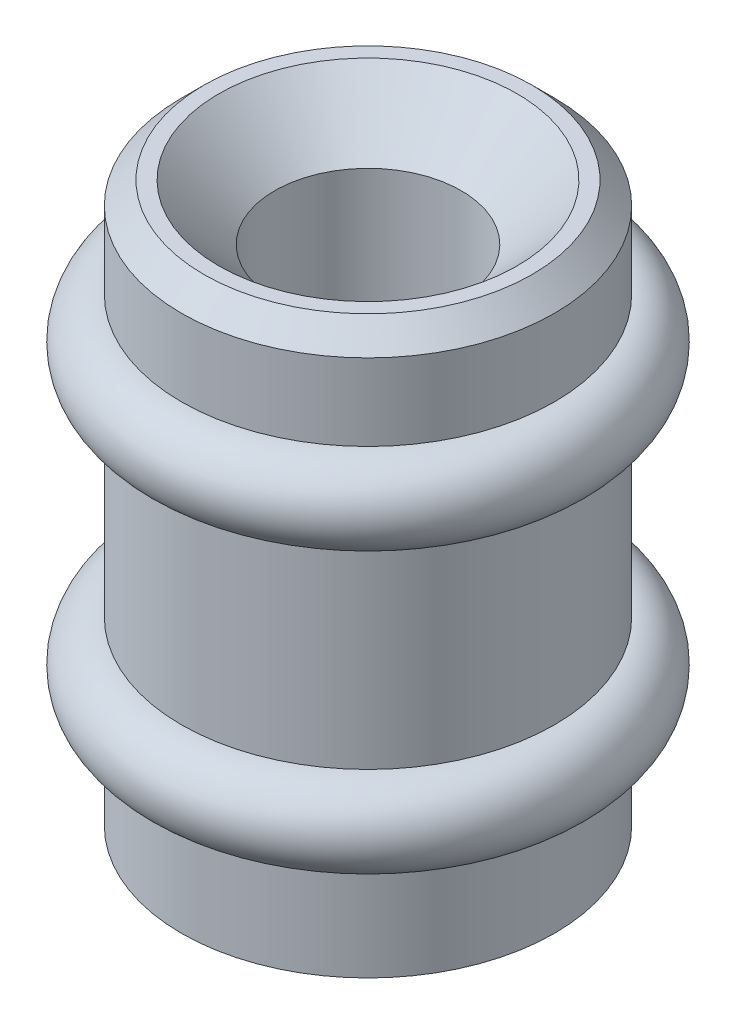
from build123d import *

# Parameters (mm, degrees)
SKETCH1_R           = 3.175
BOSS_EXTRUDE1_DEPTH = 9.525
SKETCH2_R           = 0.69375
SKETCH3_R           = 1.5875
CUT_EXTRUDE1_DEPTH  = 12.7
CHAMFER1_SIZE       = 0.9525
CHAMFER3_SIZE       = 0.381


with BuildPart() as part:
    # Sketch1 → Boss-Extrude1 (new body)
    with BuildSketch(Plane(origin=(0, 0, 0), x_dir=(1, 0, 0), z_dir=(0, 1, 0))):
        with Locations(Location((0, 0, 0), (0, 0, 90))):
            Circle(SKETCH1_R)
    extrude(amount=BOSS_EXTRUDE1_DEPTH)

    # Sketch2 → Revolve1 (revolve)
    with BuildSketch(Plane.XY, mode=Mode.PRIVATE) as revolve1_sk:
        with Locations((-3.175, 7.14375)):
            Circle(SKETCH2_R)
        with Locations((-3.175, 2.38125)):
            Circle(SKETCH2_R)
    revolve(revolve1_sk.sketch.rotate(Axis((0, 0, 0), (0, 1, 0)), 270), axis=Axis((0, 0, 0), (0, 1, 0)))

    # Sketch3 → Cut-Extrude1 (cut)
    with BuildSketch(Plane(origin=(0, 9.525, 0), x_dir=(1, 0, 0), z_dir=(0, 1, 0))):
        with Locations(Location((0, 0, 0), (0, 0, 270))):
            Circle(SKETCH3_R)
    extrude(amount=-CUT_EXTRUDE1_DEPTH, mode=Mode.SUBTRACT)

    # Chamfer1
    chamfer1_edges = [part.edges().sort_by_distance(p)[0] for p in [
        (0, 9.525, -1.5875),
    ]]
    chamfer(chamfer1_edges, length=CHAMFER1_SIZE)

    # Chamfer3
    chamfer3_edges = [part.edges().sort_by_distance(p)[0] for p in [
        (0, 9.525, 3.175),
    ]]
    chamfer(chamfer3_edges, length=CHAMFER3_SIZE)


solid = part.part
